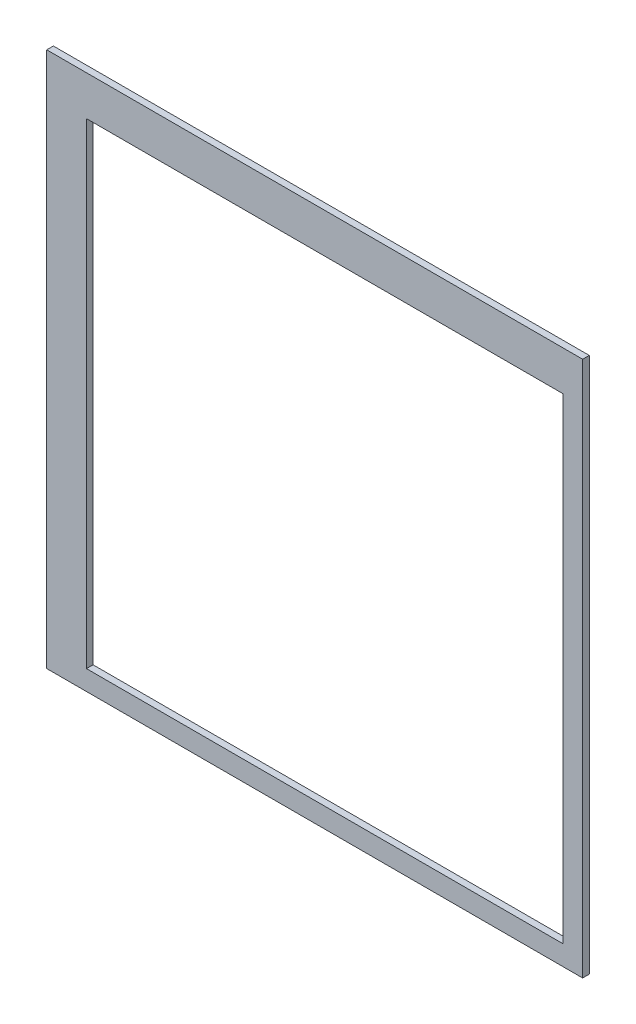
from build123d import *

# Parameters (mm, degrees)
SKETCH1_W           = 405
SKETCH1_H           = 405
SKETCH1_W_2         = 360
SKETCH1_H_2         = 360
BOSS_EXTRUDE1_DEPTH = 2.5


with BuildPart() as part:
    # Sketch1 → Boss-Extrude1 (new, symmetric)
    with BuildSketch(Plane.XY):
        with Locations((-7.5, 7.5)):
            Rectangle(SKETCH1_W, SKETCH1_H)
        Rectangle(SKETCH1_W_2, SKETCH1_H_2, mode=Mode.SUBTRACT)
    extrude(amount=BOSS_EXTRUDE1_DEPTH, both=True)


solid = part.part
